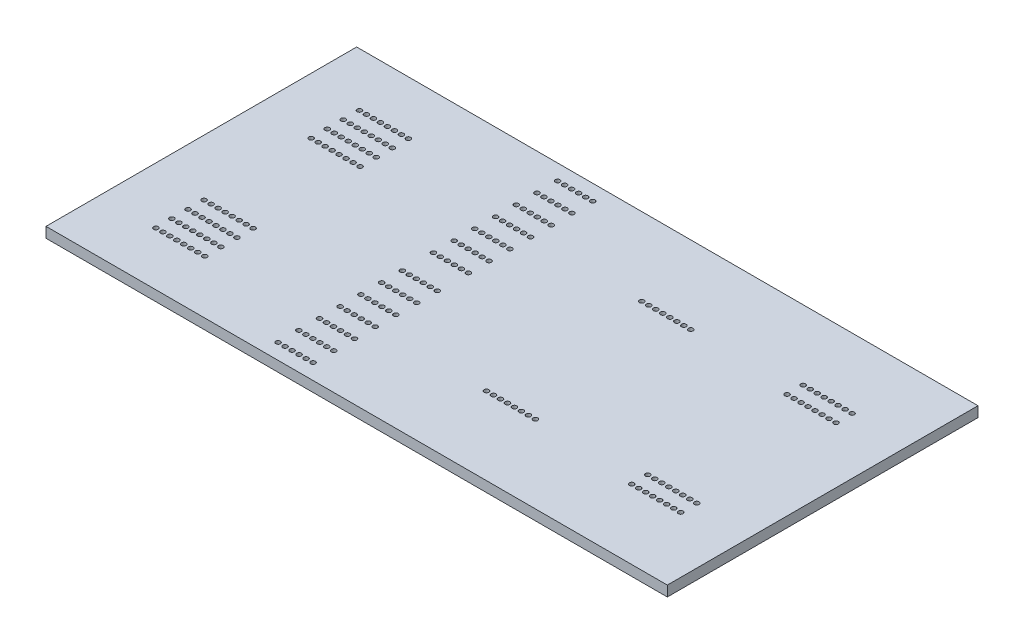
from build123d import *

# Parameters (mm, degrees)
ESQUISSE2_W                     = 120
ESQUISSE2_H                     = 30
BOSS_EXTRU_1_DEPTH              = 2
ENL_V_MAT_EXTRU_3_REACH         = 63.879
ESQUISSE8_R                     = 0.45
R_P_TITION_LIN_AIRE4_COUNT      = 8
R_P_TITION_LIN_AIRE4_PITCH      = 1.35
R_P_TITION_LIN_AIRE4_COUNT_DIR2 = 4
R_P_TITION_LIN_AIRE4_PITCH_DIR2 = 3.111
ENL_V_MAT_EXTRU_4_REACH         = 63.879
ESQUISSE10_R                    = 0.45
R_P_TITION_LIN_AIRE5_COUNT      = 6
R_P_TITION_LIN_AIRE5_PITCH      = 1.35
R_P_TITION_LIN_AIRE5_COUNT_DIR2 = 7
R_P_TITION_LIN_AIRE5_PITCH_DIR2 = 4
ENL_V_MAT_EXTRU_5_REACH         = 63.879
ESQUISSE12_R                    = 0.45
R_P_TITION_LIN_AIRE6_COUNT      = 8
R_P_TITION_LIN_AIRE6_PITCH      = 1.35
ENL_V_MAT_EXTRU_6_REACH         = 63.879
ESQUISSE14_R                    = 0.45
R_P_TITION_LIN_AIRE7_COUNT      = 8
R_P_TITION_LIN_AIRE7_PITCH      = 1.35
R_P_TITION_LIN_AIRE7_COUNT_DIR2 = 2
R_P_TITION_LIN_AIRE7_PITCH_DIR2 = 3.11


with BuildPart() as part:
    # Esquisse2 → Boss.-Extru.1 (new body)
    with BuildSketch(Plane(origin=(0, 0, 0), x_dir=(1, 0, 0), z_dir=(0, 1, 0))):
        Rectangle(ESQUISSE2_W, ESQUISSE2_H)
    extrude(amount=BOSS_EXTRU_1_DEPTH)

    # Esquisse8 → Enl_v. mat.-Extru.3 (cut, up to next)
    with BuildSketch(Plane(origin=(0, 2, 0), x_dir=(1, 0, 0), z_dir=(0, 1, 0)), mode=Mode.PRIVATE) as enl_v_mat_extru_3_sk1:
        with Locations(Location((-49.125, 4.6665, 0), (0, 0, 270))):
            Circle(ESQUISSE8_R)
    enl_v_mat_extru_3_tool1 = extrude(enl_v_mat_extru_3_sk1.sketch, amount=-ENL_V_MAT_EXTRU_3_REACH, mode=Mode.PRIVATE) & part.part
    enl_v_mat_extru_3 = enl_v_mat_extru_3_tool1.solids().sort_by_distance((-49.125, 2, -4.6665))[0]
    add(enl_v_mat_extru_3, mode=Mode.SUBTRACT)

    # R_p_tition lin_aire4: Enl_v. mat.-Extru.3 8 × 4
    with Locations(*[(i * R_P_TITION_LIN_AIRE4_PITCH, 0, j * R_P_TITION_LIN_AIRE4_PITCH_DIR2) for i in range(R_P_TITION_LIN_AIRE4_COUNT) for j in range(R_P_TITION_LIN_AIRE4_COUNT_DIR2) if (i, j) != (0, 0)]):
        add(enl_v_mat_extru_3, mode=Mode.SUBTRACT)

    # Esquisse10 → Enl_v. mat.-Extru.4 (cut, up to next)
    with BuildSketch(Plane(origin=(0, 2, 0), x_dir=(1, 0, 0), z_dir=(0, 1, 0)), mode=Mode.PRIVATE) as enl_v_mat_extru_4_sk1:
        with Locations(Location((-18.175, 12, 0), (0, 0, 270))):
            Circle(ESQUISSE10_R)
    enl_v_mat_extru_4_tool1 = extrude(enl_v_mat_extru_4_sk1.sketch, amount=-ENL_V_MAT_EXTRU_4_REACH, mode=Mode.PRIVATE) & part.part
    enl_v_mat_extru_4 = enl_v_mat_extru_4_tool1.solids().sort_by_distance((-18.175, 2, -12))[0]
    add(enl_v_mat_extru_4, mode=Mode.SUBTRACT)

    # R_p_tition lin_aire5: Enl_v. mat.-Extru.4 6 × 7
    with Locations(*[(i * R_P_TITION_LIN_AIRE5_PITCH, 0, j * R_P_TITION_LIN_AIRE5_PITCH_DIR2) for i in range(R_P_TITION_LIN_AIRE5_COUNT) for j in range(R_P_TITION_LIN_AIRE5_COUNT_DIR2) if (i, j) != (0, 0)]):
        add(enl_v_mat_extru_4, mode=Mode.SUBTRACT)

    # Esquisse12 → Enl_v. mat.-Extru.5 (cut, up to next)
    with BuildSketch(Plane(origin=(0, 2, 0), x_dir=(1, 0, 0), z_dir=(0, 1, 0)), mode=Mode.PRIVATE) as enl_v_mat_extru_5_sk1:
        with Locations(Location((10.075, 0, 0), (0, 0, 270))):
            Circle(ESQUISSE12_R)
    enl_v_mat_extru_5_tool1 = extrude(enl_v_mat_extru_5_sk1.sketch, amount=-ENL_V_MAT_EXTRU_5_REACH, mode=Mode.PRIVATE) & part.part
    enl_v_mat_extru_5 = enl_v_mat_extru_5_tool1.solids().sort_by_distance((10.075, 2, 0))[0]
    add(enl_v_mat_extru_5, mode=Mode.SUBTRACT)

    # R_p_tition lin_aire6: Enl_v. mat.-Extru.5 ×8
    with Locations(*[(i * R_P_TITION_LIN_AIRE6_PITCH, 0, 0) for i in range(1, R_P_TITION_LIN_AIRE6_COUNT)]):
        add(enl_v_mat_extru_5, mode=Mode.SUBTRACT)

    # Esquisse14 → Enl_v. mat.-Extru.6 (cut, up to next)
    with BuildSketch(Plane(origin=(0, 2, 0), x_dir=(1, 0, 0), z_dir=(0, 1, 0)), mode=Mode.PRIVATE) as enl_v_mat_extru_6_sk1:
        with Locations(Location((39.675, 1.555, 0), (0, 0, 270))):
            Circle(ESQUISSE14_R)
    enl_v_mat_extru_6_tool1 = extrude(enl_v_mat_extru_6_sk1.sketch, amount=-ENL_V_MAT_EXTRU_6_REACH, mode=Mode.PRIVATE) & part.part
    enl_v_mat_extru_6 = enl_v_mat_extru_6_tool1.solids().sort_by_distance((39.675, 2, -1.555))[0]
    add(enl_v_mat_extru_6, mode=Mode.SUBTRACT)

    # R_p_tition lin_aire7: Enl_v. mat.-Extru.6 8 × 2
    with Locations(*[(i * R_P_TITION_LIN_AIRE7_PITCH, 0, j * R_P_TITION_LIN_AIRE7_PITCH_DIR2) for i in range(R_P_TITION_LIN_AIRE7_COUNT) for j in range(R_P_TITION_LIN_AIRE7_COUNT_DIR2) if (i, j) != (0, 0)]):
        add(enl_v_mat_extru_6, mode=Mode.SUBTRACT)

    # Sym_trie1: part across plane


with BuildPart() as part_1:
    add(part.part)
    add(part.part.mirror(Plane(origin=(-60, 2, 15), x_dir=(1, 0, 0), z_dir=(0, 0, -1))))


solid = part_1.part
